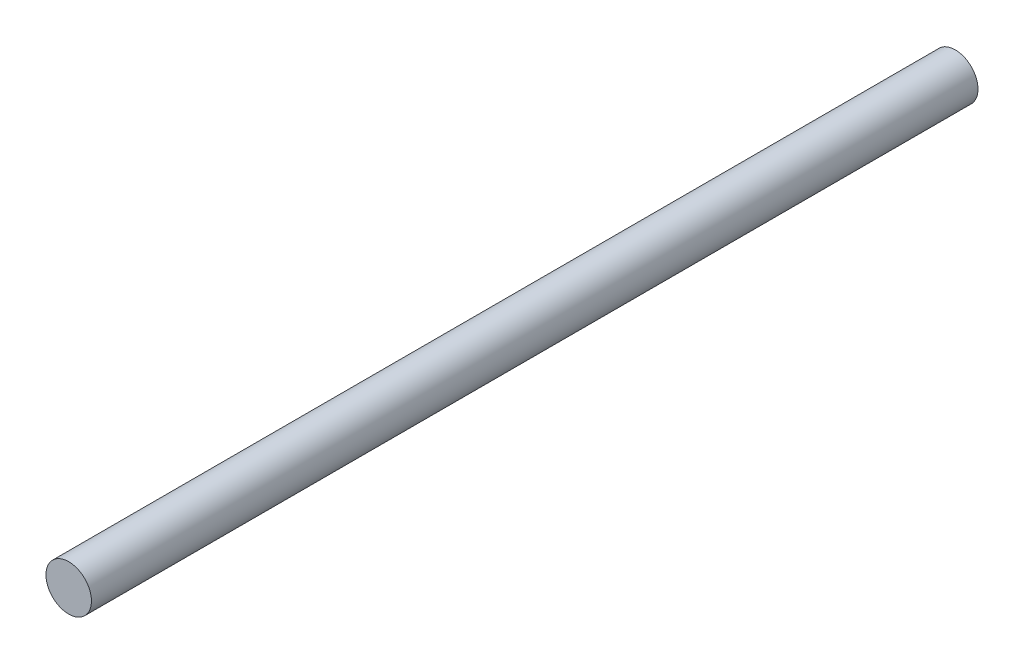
from build123d import *

# Parameters (mm, degrees)
ESQUISSE1_R        = 10
BOSS_EXTRU_1_DEPTH = 390


with BuildPart() as part:
    # Esquisse1 → Boss.-Extru.1 (new body)
    with BuildSketch(Plane.XY):
        Circle(ESQUISSE1_R)
    extrude(amount=BOSS_EXTRU_1_DEPTH)


solid = part.part
